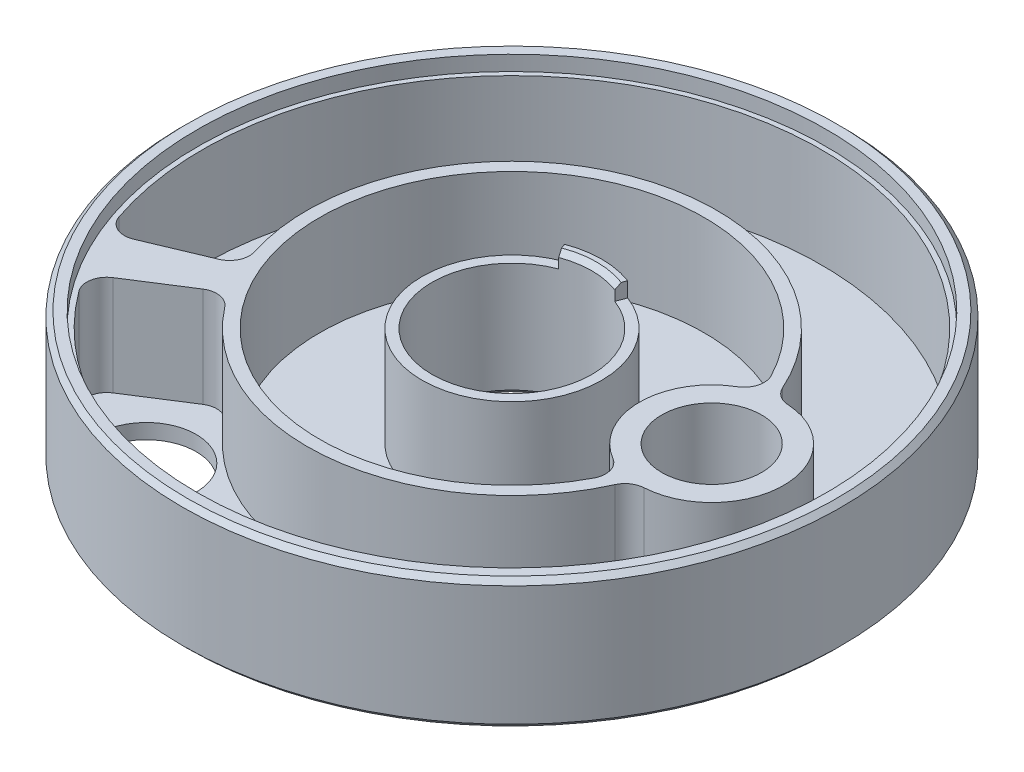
ISO-10303-21;
HEADER;
FILE_DESCRIPTION(('STEP AP214'),'2;1');
FILE_NAME('part.step','',(''),(''),'','','');
FILE_SCHEMA(('AUTOMOTIVE_DESIGN { 1 0 10303 214 1 1 1 1 }'));
ENDSEC;
DATA;
#1=APPLICATION_CONTEXT('core data for automotive mechanical design processes');
#2=APPLICATION_PROTOCOL_DEFINITION('international standard','automotive_design',2000,#1);
#3=PRODUCT_CONTEXT('',#1,'mechanical');
#4=PRODUCT('Part','Part','',(#3));
#5=PRODUCT_RELATED_PRODUCT_CATEGORY('part','',(#4));
#6=PRODUCT_DEFINITION_FORMATION('','',#4);
#7=PRODUCT_DEFINITION_CONTEXT('part definition',#1,'design');
#8=PRODUCT_DEFINITION('design','',#6,#7);
#9=PRODUCT_DEFINITION_SHAPE('','',#8);
#10=(LENGTH_UNIT() NAMED_UNIT(*) SI_UNIT(.MILLI.,.METRE.));
#11=(NAMED_UNIT(*) PLANE_ANGLE_UNIT() SI_UNIT($,.RADIAN.));
#12=(NAMED_UNIT(*) SI_UNIT($,.STERADIAN.) SOLID_ANGLE_UNIT());
#13=UNCERTAINTY_MEASURE_WITH_UNIT(LENGTH_MEASURE(1.E-05),#10,'distance_accuracy_value','');
#14=(GEOMETRIC_REPRESENTATION_CONTEXT(3) GLOBAL_UNCERTAINTY_ASSIGNED_CONTEXT((#13)) GLOBAL_UNIT_ASSIGNED_CONTEXT((#10,
#11,#12)) REPRESENTATION_CONTEXT('',''));
#15=CARTESIAN_POINT('',(0.,0.,0.));
#16=DIRECTION('',(0.,0.,1.));
#17=DIRECTION('',(1.,0.,0.));
#18=AXIS2_PLACEMENT_3D('',#15,#16,#17);
#19=CARTESIAN_POINT('',(0.,-1.5,0.));
#20=DIRECTION('',(0.,1.,0.));
#21=DIRECTION('',(0.,0.,1.));
#22=AXIS2_PLACEMENT_3D('',#19,#20,#21);
#23=PLANE('',#22);
#24=DIRECTION('',(0.351123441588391,0.,0.936329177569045));
#25=VECTOR('',#24,1.);
#26=CARTESIAN_POINT('',(-3.,-1.5,-8.));
#27=LINE('',#26,#25);
#28=CARTESIAN_POINT('',(-3.16011097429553,-1.5,-8.4269625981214));
#29=VERTEX_POINT('',#28);
#30=CARTESIAN_POINT('',(-2.80898753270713,-1.5,-7.49063342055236));
#31=VERTEX_POINT('',#30);
#32=EDGE_CURVE('E326',#29,#31,#27,.T.);
#33=ORIENTED_EDGE('',*,*,#32,.F.);
#34=CARTESIAN_POINT('',(0.,-1.5,0.));
#35=DIRECTION('',(0.,1.,0.));
#36=DIRECTION('',(0.,0.,1.));
#37=AXIS2_PLACEMENT_3D('',#34,#35,#36);
#38=CIRCLE('',#37,9.);
#39=CARTESIAN_POINT('',(3.16011097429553,-1.5,-8.4269625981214));
#40=VERTEX_POINT('',#39);
#41=EDGE_CURVE('E203',#29,#40,#38,.T.);
#42=ORIENTED_EDGE('',*,*,#41,.T.);
#43=DIRECTION('',(0.351123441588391,0.,-0.936329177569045));
#44=VECTOR('',#43,1.);
#45=CARTESIAN_POINT('',(3.,-1.5,-8.));
#46=LINE('',#45,#44);
#47=CARTESIAN_POINT('',(2.80898753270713,-1.5,-7.49063342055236));
#48=VERTEX_POINT('',#47);
#49=EDGE_CURVE('E323',#48,#40,#46,.T.);
#50=ORIENTED_EDGE('',*,*,#49,.F.);
#51=CARTESIAN_POINT('',(0.,-1.5,0.));
#52=DIRECTION('',(0.,1.,0.));
#53=DIRECTION('',(0.,0.,1.));
#54=AXIS2_PLACEMENT_3D('',#51,#52,#53);
#55=CIRCLE('',#54,8.);
#56=EDGE_CURVE('E329',#31,#48,#55,.T.);
#57=ORIENTED_EDGE('',*,*,#56,.F.);
#58=EDGE_LOOP('',(#33,#42,#50,#57));
#59=FACE_BOUND('',#58,.T.);
#60=ADVANCED_FACE('F32',(#59),#23,.T.);
#61=CARTESIAN_POINT('',(0.,0.,0.));
#62=DIRECTION('',(0.,1.,0.));
#63=DIRECTION('',(0.,0.,1.));
#64=AXIS2_PLACEMENT_3D('',#61,#62,#63);
#65=PLANE('',#64);
#66=DIRECTION('',(0.351123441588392,0.,0.936329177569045));
#67=VECTOR('',#66,1.);
#68=CARTESIAN_POINT('',(-2.80898753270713,0.,-7.49063342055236));
#69=LINE('',#68,#67);
#70=CARTESIAN_POINT('',(-3.16011097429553,0.,-8.4269625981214));
#71=VERTEX_POINT('',#70);
#72=CARTESIAN_POINT('',(-2.98454925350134,0.,-7.95879800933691));
#73=VERTEX_POINT('',#72);
#74=EDGE_CURVE('E335',#71,#73,#69,.T.);
#75=ORIENTED_EDGE('',*,*,#74,.T.);
#76=CARTESIAN_POINT('',(0.,0.,0.));
#77=DIRECTION('',(0.,1.,0.));
#78=DIRECTION('',(0.,0.,1.));
#79=AXIS2_PLACEMENT_3D('',#76,#77,#78);
#80=CIRCLE('',#79,8.50000000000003);
#81=CARTESIAN_POINT('',(2.98454925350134,0.,-7.95879800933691));
#82=VERTEX_POINT('',#81);
#83=EDGE_CURVE('E363',#73,#82,#80,.F.);
#84=ORIENTED_EDGE('',*,*,#83,.T.);
#85=DIRECTION('',(0.351123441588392,0.,-0.936329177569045));
#86=VECTOR('',#85,1.);
#87=CARTESIAN_POINT('',(2.80898753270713,0.,-7.49063342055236));
#88=LINE('',#87,#86);
#89=CARTESIAN_POINT('',(3.16011097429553,0.,-8.4269625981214));
#90=VERTEX_POINT('',#89);
#91=EDGE_CURVE('E327',#82,#90,#88,.T.);
#92=ORIENTED_EDGE('',*,*,#91,.T.);
#93=CARTESIAN_POINT('',(0.,0.,0.));
#94=DIRECTION('',(0.,1.,0.));
#95=DIRECTION('',(0.,0.,1.));
#96=AXIS2_PLACEMENT_3D('',#93,#94,#95);
#97=CIRCLE('',#96,9.);
#98=EDGE_CURVE('E320',#90,#71,#97,.T.);
#99=ORIENTED_EDGE('',*,*,#98,.T.);
#100=EDGE_LOOP('',(#75,#84,#92,#99));
#101=FACE_BOUND('',#100,.T.);
#102=ADVANCED_FACE('F396',(#101),#65,.T.);
#103=CARTESIAN_POINT('',(0.,-13.,0.));
#104=DIRECTION('',(0.,1.,0.));
#105=DIRECTION('',(0.,0.,1.));
#106=AXIS2_PLACEMENT_3D('',#103,#104,#105);
#107=CYLINDRICAL_SURFACE('',#106,8.);
#108=CARTESIAN_POINT('',(0.,-12.5,0.));
#109=DIRECTION('',(0.,1.,0.));
#110=DIRECTION('',(0.,0.,1.));
#111=AXIS2_PLACEMENT_3D('',#108,#109,#110);
#112=CIRCLE('',#111,8.);
#113=CARTESIAN_POINT('',(0.,-12.5,8.));
#114=VERTEX_POINT('',#113);
#115=EDGE_CURVE('E353',#114,#114,#112,.F.);
#116=ORIENTED_EDGE('',*,*,#115,.T.);
#117=EDGE_LOOP('',(#116));
#118=FACE_BOUND('',#117,.T.);
#119=DIRECTION('',(0.,1.,0.));
#120=VECTOR('',#119,1.);
#121=CARTESIAN_POINT('',(2.80898753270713,-1.5,-7.49063342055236));
#122=LINE('',#121,#120);
#123=CARTESIAN_POINT('',(2.80898753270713,-0.500000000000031,-7.49063342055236));
#124=VERTEX_POINT('',#123);
#125=EDGE_CURVE('E339',#48,#124,#122,.T.);
#126=ORIENTED_EDGE('',*,*,#125,.T.);
#127=CARTESIAN_POINT('',(0.,-0.500000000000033,0.));
#128=DIRECTION('',(0.,1.,0.));
#129=DIRECTION('',(0.,0.,1.));
#130=AXIS2_PLACEMENT_3D('',#127,#128,#129);
#131=CIRCLE('',#130,8.);
#132=CARTESIAN_POINT('',(-2.80898753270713,-0.500000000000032,-7.49063342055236));
#133=VERTEX_POINT('',#132);
#134=EDGE_CURVE('E358',#124,#133,#131,.T.);
#135=ORIENTED_EDGE('',*,*,#134,.T.);
#136=DIRECTION('',(0.,1.,0.));
#137=VECTOR('',#136,1.);
#138=CARTESIAN_POINT('',(-2.80898753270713,-1.5,-7.49063342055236));
#139=LINE('',#138,#137);
#140=EDGE_CURVE('E343',#31,#133,#139,.T.);
#141=ORIENTED_EDGE('',*,*,#140,.F.);
#142=ORIENTED_EDGE('',*,*,#56,.T.);
#143=EDGE_LOOP('',(#126,#135,#141,#142));
#144=FACE_BOUND('',#143,.T.);
#145=ADVANCED_FACE('F403',(#118,#144),#107,.F.);
#146=CARTESIAN_POINT('',(0.,-13.,0.));
#147=DIRECTION('',(0.,1.,0.));
#148=DIRECTION('',(0.,0.,1.));
#149=AXIS2_PLACEMENT_3D('',#146,#147,#148);
#150=CYLINDRICAL_SURFACE('',#149,33.);
#151=CARTESIAN_POINT('',(0.,-12.5,0.));
#152=DIRECTION('',(0.,1.,0.));
#153=DIRECTION('',(0.,0.,1.));
#154=AXIS2_PLACEMENT_3D('',#151,#152,#153);
#155=CIRCLE('',#154,33.);
#156=CARTESIAN_POINT('',(0.,-12.5,33.));
#157=VERTEX_POINT('',#156);
#158=EDGE_CURVE('E40',#157,#157,#155,.T.);
#159=CARTESIAN_POINT('',(0.,-0.499999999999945,0.));
#160=DIRECTION('',(0.,1.,0.));
#161=DIRECTION('',(0.,0.,1.));
#162=AXIS2_PLACEMENT_3D('',#159,#160,#161);
#163=CIRCLE('',#162,33.);
#164=CARTESIAN_POINT('',(0.,-0.499999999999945,33.));
#165=VERTEX_POINT('',#164);
#166=EDGE_CURVE('E373',#165,#165,#163,.F.);
#167=CARTESIAN_POINT('',(0.,-12.5,33.));
#168=CARTESIAN_POINT('',(0.,-12.375,33.));
#169=CARTESIAN_POINT('',(0.,-12.25,33.));
#170=CARTESIAN_POINT('',(0.,-12.,33.));
#171=CARTESIAN_POINT('',(0.,-11.875,33.));
#172=CARTESIAN_POINT('',(0.,-11.625,33.));
#173=CARTESIAN_POINT('',(0.,-11.5,33.));
#174=CARTESIAN_POINT('',(0.,-11.25,33.));
#175=CARTESIAN_POINT('',(0.,-11.125,33.));
#176=CARTESIAN_POINT('',(0.,-10.875,33.));
#177=CARTESIAN_POINT('',(0.,-10.75,33.));
#178=CARTESIAN_POINT('',(0.,-10.5,33.));
#179=CARTESIAN_POINT('',(0.,-10.375,33.));
#180=CARTESIAN_POINT('',(0.,-10.125,33.));
#181=CARTESIAN_POINT('',(0.,-9.99999999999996,33.));
#182=CARTESIAN_POINT('',(0.,-9.74999999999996,33.));
#183=CARTESIAN_POINT('',(0.,-9.62499999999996,33.));
#184=CARTESIAN_POINT('',(0.,-9.37499999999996,33.));
#185=CARTESIAN_POINT('',(0.,-9.24999999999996,33.));
#186=CARTESIAN_POINT('',(0.,-8.99999999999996,33.));
#187=CARTESIAN_POINT('',(0.,-8.87499999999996,33.));
#188=CARTESIAN_POINT('',(0.,-8.62499999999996,33.));
#189=CARTESIAN_POINT('',(0.,-8.49999999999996,33.));
#190=CARTESIAN_POINT('',(0.,-8.24999999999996,33.));
#191=CARTESIAN_POINT('',(0.,-8.12499999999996,33.));
#192=CARTESIAN_POINT('',(0.,-7.87499999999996,33.));
#193=CARTESIAN_POINT('',(0.,-7.74999999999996,33.));
#194=CARTESIAN_POINT('',(0.,-7.49999999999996,33.));
#195=CARTESIAN_POINT('',(0.,-7.37499999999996,33.));
#196=CARTESIAN_POINT('',(0.,-7.12499999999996,33.));
#197=CARTESIAN_POINT('',(0.,-6.99999999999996,33.));
#198=CARTESIAN_POINT('',(0.,-6.74999999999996,33.));
#199=CARTESIAN_POINT('',(0.,-6.62499999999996,33.));
#200=CARTESIAN_POINT('',(0.,-6.37499999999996,33.));
#201=CARTESIAN_POINT('',(0.,-6.24999999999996,33.));
#202=CARTESIAN_POINT('',(0.,-5.99999999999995,33.));
#203=CARTESIAN_POINT('',(0.,-5.87499999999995,33.));
#204=CARTESIAN_POINT('',(0.,-5.62499999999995,33.));
#205=CARTESIAN_POINT('',(0.,-5.49999999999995,33.));
#206=CARTESIAN_POINT('',(0.,-5.24999999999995,33.));
#207=CARTESIAN_POINT('',(0.,-5.12499999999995,33.));
#208=CARTESIAN_POINT('',(0.,-4.87499999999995,33.));
#209=CARTESIAN_POINT('',(0.,-4.74999999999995,33.));
#210=CARTESIAN_POINT('',(0.,-4.49999999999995,33.));
#211=CARTESIAN_POINT('',(0.,-4.37499999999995,33.));
#212=CARTESIAN_POINT('',(0.,-4.12499999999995,33.));
#213=CARTESIAN_POINT('',(0.,-3.99999999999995,33.));
#214=CARTESIAN_POINT('',(0.,-3.74999999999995,33.));
#215=CARTESIAN_POINT('',(0.,-3.62499999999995,33.));
#216=CARTESIAN_POINT('',(0.,-3.37499999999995,33.));
#217=CARTESIAN_POINT('',(0.,-3.24999999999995,33.));
#218=CARTESIAN_POINT('',(0.,-2.99999999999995,33.));
#219=CARTESIAN_POINT('',(0.,-2.87499999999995,33.));
#220=CARTESIAN_POINT('',(0.,-2.62499999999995,33.));
#221=CARTESIAN_POINT('',(0.,-2.49999999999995,33.));
#222=CARTESIAN_POINT('',(0.,-2.24999999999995,33.));
#223=CARTESIAN_POINT('',(0.,-2.12499999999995,33.));
#224=CARTESIAN_POINT('',(0.,-1.87499999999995,33.));
#225=CARTESIAN_POINT('',(0.,-1.74999999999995,33.));
#226=CARTESIAN_POINT('',(0.,-1.49999999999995,33.));
#227=CARTESIAN_POINT('',(0.,-1.37499999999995,33.));
#228=CARTESIAN_POINT('',(0.,-1.12499999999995,33.));
#229=CARTESIAN_POINT('',(0.,-0.999999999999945,33.));
#230=CARTESIAN_POINT('',(0.,-0.749999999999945,33.));
#231=CARTESIAN_POINT('',(0.,-0.624999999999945,33.));
#232=CARTESIAN_POINT('',(0.,-0.499999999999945,33.));
#233=B_SPLINE_CURVE_WITH_KNOTS('',3,(#167,#168,#169,#170,#171,#172,#173,#174,#175,#176,#177,
#178,#179,#180,#181,#182,#183,#184,#185,#186,#187,#188,#189,#190,#191,#192,#193,#194,#195,#196,
#197,#198,#199,#200,#201,#202,#203,#204,#205,#206,#207,#208,#209,#210,#211,#212,#213,#214,#215,
#216,#217,#218,#219,#220,#221,#222,#223,#224,#225,#226,#227,#228,#229,#230,#231,#232),
.UNSPECIFIED.,.F.,.F.,(4,2,2,2,2,2,2,2,2,2,2,2,2,2,2,2,2,2,2,2,2,2,2,2,2,2,2,2,2,2,2,2,4),(0.,
0.375,0.750000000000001,1.125,1.5,1.875,2.25,2.625,3.,3.375,3.75,4.12500000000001,
4.50000000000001,4.87500000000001,5.25000000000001,5.62500000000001,6.00000000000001,
6.37500000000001,6.75000000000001,7.12500000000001,7.50000000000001,7.87500000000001,
8.25000000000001,8.62500000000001,9.00000000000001,9.37500000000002,9.75000000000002,10.125,
10.5,10.875,11.25,11.625,12.),.UNSPECIFIED.);
#234=EDGE_CURVE('BSEAM378',#157,#165,#233,.T.);
#235=ORIENTED_EDGE('',*,*,#158,.T.);
#236=ORIENTED_EDGE('',*,*,#166,.T.);
#237=ORIENTED_EDGE('',*,*,#234,.T.);
#238=ORIENTED_EDGE('',*,*,#234,.F.);
#239=EDGE_LOOP('',(#235,#237,#236,#238));
#240=FACE_BOUND('',#239,.T.);
#241=ADVANCED_FACE('F378',(#240),#150,.T.);
#242=CARTESIAN_POINT('',(0.,-13.,0.));
#243=DIRECTION('',(0.,1.,0.));
#244=DIRECTION('',(0.,0.,1.));
#245=AXIS2_PLACEMENT_3D('',#242,#243,#244);
#246=PLANE('',#245);
#247=CARTESIAN_POINT('',(-16.6132477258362,-13.,20.));
#248=DIRECTION('',(0.,1.,0.));
#249=DIRECTION('',(0.,0.,1.));
#250=AXIS2_PLACEMENT_3D('',#247,#248,#249);
#251=CIRCLE('',#250,5.);
#252=CARTESIAN_POINT('',(-16.6132477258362,-13.,25.));
#253=VERTEX_POINT('',#252);
#254=EDGE_CURVE('E549',#253,#253,#251,.T.);
#255=ORIENTED_EDGE('',*,*,#254,.T.);
#256=EDGE_LOOP('',(#255));
#257=FACE_BOUND('',#256,.T.);
#258=CARTESIAN_POINT('',(20.,-13.,0.));
#259=DIRECTION('',(0.,1.,0.));
#260=DIRECTION('',(0.,0.,1.));
#261=AXIS2_PLACEMENT_3D('',#258,#259,#260);
#262=CIRCLE('',#261,5.);
#263=CARTESIAN_POINT('',(20.,-13.,5.));
#264=VERTEX_POINT('',#263);
#265=EDGE_CURVE('E317',#264,#264,#262,.T.);
#266=ORIENTED_EDGE('',*,*,#265,.T.);
#267=EDGE_LOOP('',(#266));
#268=FACE_BOUND('',#267,.T.);
#269=CARTESIAN_POINT('',(0.,-13.,0.));
#270=DIRECTION('',(0.,1.,0.));
#271=DIRECTION('',(0.,0.,1.));
#272=AXIS2_PLACEMENT_3D('',#269,#270,#271);
#273=CIRCLE('',#272,8.49999999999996);
#274=CARTESIAN_POINT('',(0.,-13.,8.49999999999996));
#275=VERTEX_POINT('',#274);
#276=EDGE_CURVE('E370',#275,#275,#273,.T.);
#277=ORIENTED_EDGE('',*,*,#276,.T.);
#278=EDGE_LOOP('',(#277));
#279=FACE_BOUND('',#278,.T.);
#280=CARTESIAN_POINT('',(0.,-13.,0.));
#281=DIRECTION('',(0.,1.,0.));
#282=DIRECTION('',(0.,0.,1.));
#283=AXIS2_PLACEMENT_3D('',#280,#281,#282);
#284=CIRCLE('',#283,32.5);
#285=CARTESIAN_POINT('',(0.,-13.,32.5));
#286=VERTEX_POINT('',#285);
#287=EDGE_CURVE('E367',#286,#286,#284,.F.);
#288=ORIENTED_EDGE('',*,*,#287,.T.);
#289=EDGE_LOOP('',(#288));
#290=FACE_BOUND('',#289,.T.);
#291=ADVANCED_FACE('F435',(#257,#268,#279,#290),#246,.F.);
#292=CARTESIAN_POINT('',(0.,0.,0.));
#293=DIRECTION('',(0.,1.,0.));
#294=DIRECTION('',(0.,0.,1.));
#295=AXIS2_PLACEMENT_3D('',#292,#293,#294);
#296=CIRCLE('',#295,32.5);
#297=CARTESIAN_POINT('',(0.,0.,32.5));
#298=VERTEX_POINT('',#297);
#299=EDGE_CURVE('E11',#298,#298,#296,.T.);
#300=ORIENTED_EDGE('',*,*,#299,.T.);
#301=EDGE_LOOP('',(#300));
#302=FACE_BOUND('',#301,.T.);
#303=CARTESIAN_POINT('',(0.,0.,0.));
#304=DIRECTION('',(0.,1.,0.));
#305=DIRECTION('',(0.,0.,1.));
#306=AXIS2_PLACEMENT_3D('',#303,#304,#305);
#307=CIRCLE('',#306,31.5);
#308=CARTESIAN_POINT('',(0.,0.,31.5));
#309=VERTEX_POINT('',#308);
#310=EDGE_CURVE('E342',#309,#309,#307,.T.);
#311=ORIENTED_EDGE('',*,*,#310,.F.);
#312=EDGE_LOOP('',(#311));
#313=FACE_BOUND('',#312,.T.);
#314=ADVANCED_FACE('F406',(#302,#313),#65,.T.);
#315=CARTESIAN_POINT('',(0.,-1.5,0.));
#316=DIRECTION('',(0.,1.,0.));
#317=DIRECTION('',(0.,0.,1.));
#318=AXIS2_PLACEMENT_3D('',#315,#316,#317);
#319=CYLINDRICAL_SURFACE('',#318,31.5);
#320=CARTESIAN_POINT('',(0.,-1.5,0.));
#321=DIRECTION('',(0.,1.,0.));
#322=DIRECTION('',(0.,0.,1.));
#323=AXIS2_PLACEMENT_3D('',#320,#321,#322);
#324=CIRCLE('',#323,31.5);
#325=CARTESIAN_POINT('',(0.,-1.5,31.5));
#326=VERTEX_POINT('',#325);
#327=EDGE_CURVE('E350',#326,#326,#324,.T.);
#328=ORIENTED_EDGE('',*,*,#327,.F.);
#329=EDGE_LOOP('',(#328));
#330=FACE_BOUND('',#329,.T.);
#331=ORIENTED_EDGE('',*,*,#310,.T.);
#332=EDGE_LOOP('',(#331));
#333=FACE_BOUND('',#332,.T.);
#334=ADVANCED_FACE('F412',(#330,#333),#319,.F.);
#335=CARTESIAN_POINT('',(15.3140625,-1.5,7.93989859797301));
#336=DIRECTION('',(0.,1.,0.));
#337=DIRECTION('',(0.,0.,1.));
#338=AXIS2_PLACEMENT_3D('',#335,#336,#337);
#339=CIRCLE('',#338,2.);
#340=CARTESIAN_POINT('',(17.0896059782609,-1.5,8.86046655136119));
#341=VERTEX_POINT('',#340);
#342=CARTESIAN_POINT('',(16.3305850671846,-1.5,6.21749276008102));
#343=VERTEX_POINT('',#342);
#344=EDGE_CURVE('E52',#341,#343,#339,.T.);
#345=ORIENTED_EDGE('',*,*,#344,.F.);
#346=CARTESIAN_POINT('',(0.,-1.5,0.));
#347=DIRECTION('',(0.,1.,0.));
#348=DIRECTION('',(0.,0.,1.));
#349=AXIS2_PLACEMENT_3D('',#346,#347,#348);
#350=CIRCLE('',#349,19.25);
#351=CARTESIAN_POINT('',(17.0896059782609,-1.5,-8.86046655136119));
#352=VERTEX_POINT('',#351);
#353=EDGE_CURVE('E197',#352,#341,#350,.T.);
#354=ORIENTED_EDGE('',*,*,#353,.F.);
#355=CARTESIAN_POINT('',(15.3140625,-1.5,-7.93989859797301));
#356=DIRECTION('',(0.,1.,0.));
#357=DIRECTION('',(0.,0.,-1.));
#358=AXIS2_PLACEMENT_3D('',#355,#356,#357);
#359=CIRCLE('',#358,2.);
#360=CARTESIAN_POINT('',(16.3305850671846,-1.5,-6.21749276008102));
#361=VERTEX_POINT('',#360);
#362=EDGE_CURVE('E200',#361,#352,#359,.T.);
#363=ORIENTED_EDGE('',*,*,#362,.F.);
#364=CARTESIAN_POINT('',(20.,-1.5,0.));
#365=DIRECTION('',(0.,-1.,0.));
#366=DIRECTION('',(0.,0.,1.));
#367=AXIS2_PLACEMENT_3D('',#364,#365,#366);
#368=CIRCLE('',#367,7.21954445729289);
#369=EDGE_CURVE('E209',#343,#361,#368,.T.);
#370=ORIENTED_EDGE('',*,*,#369,.F.);
#371=EDGE_LOOP('',(#345,#354,#363,#370));
#372=FACE_BOUND('',#371,.T.);
#373=CARTESIAN_POINT('',(20.53125,-1.5,-9.20422584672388));
#374=DIRECTION('',(0.,1.,0.));
#375=DIRECTION('',(0.,0.,1.));
#376=AXIS2_PLACEMENT_3D('',#373,#374,#375);
#377=CIRCLE('',#376,2.);
#378=CARTESIAN_POINT('',(18.70625,-1.5,-8.38607243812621));
#379=VERTEX_POINT('',#378);
#380=CARTESIAN_POINT('',(20.4160056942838,-1.5,-7.20754891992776));
#381=VERTEX_POINT('',#380);
#382=EDGE_CURVE('E216',#379,#381,#377,.T.);
#383=ORIENTED_EDGE('',*,*,#382,.F.);
#384=CARTESIAN_POINT('',(0.,-1.5,0.));
#385=DIRECTION('',(0.,-1.,0.));
#386=DIRECTION('',(0.,0.,1.));
#387=AXIS2_PLACEMENT_3D('',#384,#385,#386);
#388=CIRCLE('',#387,20.5);
#389=CARTESIAN_POINT('',(-19.5309015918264,-1.5,6.22847356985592));
#390=VERTEX_POINT('',#389);
#391=EDGE_CURVE('E224',#390,#379,#388,.T.);
#392=ORIENTED_EDGE('',*,*,#391,.F.);
#393=CARTESIAN_POINT('',(-21.4363554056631,-1.5,6.83612952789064));
#394=DIRECTION('',(0.,1.,0.));
#395=DIRECTION('',(0.,0.,1.));
#396=AXIS2_PLACEMENT_3D('',#393,#394,#395);
#397=CIRCLE('',#396,2.);
#398=CARTESIAN_POINT('',(-20.6617311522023,-1.5,8.6800268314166));
#399=VERTEX_POINT('',#398);
#400=EDGE_CURVE('E287',#399,#390,#397,.T.);
#401=ORIENTED_EDGE('',*,*,#400,.F.);
#402=DIRECTION('',(0.921948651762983,0.,-0.387312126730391));
#403=VECTOR('',#402,1.);
#404=CARTESIAN_POINT('',(-20.6617311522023,-1.5,8.6800268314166));
#405=LINE('',#404,#403);
#406=CARTESIAN_POINT('',(-26.6728524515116,-1.5,11.205308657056));
#407=VERTEX_POINT('',#406);
#408=EDGE_CURVE('E284',#407,#399,#405,.T.);
#409=ORIENTED_EDGE('',*,*,#408,.F.);
#410=CARTESIAN_POINT('',(-27.4474767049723,-1.5,9.36141135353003));
#411=DIRECTION('',(0.,1.,0.));
#412=DIRECTION('',(0.,0.,-1.));
#413=AXIS2_PLACEMENT_3D('',#410,#411,#412);
#414=CIRCLE('',#413,2.);
#415=CARTESIAN_POINT('',(-29.3404061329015,-1.5,10.0070259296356));
#416=VERTEX_POINT('',#415);
#417=EDGE_CURVE('E281',#416,#407,#414,.T.);
#418=ORIENTED_EDGE('',*,*,#417,.F.);
#419=CARTESIAN_POINT('',(0.,-1.5,0.));
#420=DIRECTION('',(0.,1.,0.));
#421=DIRECTION('',(0.,0.,1.));
#422=AXIS2_PLACEMENT_3D('',#419,#420,#421);
#423=CIRCLE('',#422,31.);
#424=CARTESIAN_POINT('',(-24.9120718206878,-1.5,18.4496254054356));
#425=VERTEX_POINT('',#424);
#426=EDGE_CURVE('E278',#425,#416,#423,.T.);
#427=ORIENTED_EDGE('',*,*,#426,.F.);
#428=CARTESIAN_POINT('',(-23.3048413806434,-1.5,17.2593269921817));
#429=DIRECTION('',(0.,1.,0.));
#430=DIRECTION('',(0.,0.,1.));
#431=AXIS2_PLACEMENT_3D('',#428,#429,#430);
#432=CIRCLE('',#431,2.);
#433=CARTESIAN_POINT('',(-24.3814622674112,-1.5,15.5738337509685));
#434=VERTEX_POINT('',#433);
#435=EDGE_CURVE('E275',#434,#425,#432,.T.);
#436=ORIENTED_EDGE('',*,*,#435,.F.);
#437=DIRECTION('',(-0.842746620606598,0.,0.538310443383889));
#438=VECTOR('',#437,1.);
#439=CARTESIAN_POINT('',(-18.8867395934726,-1.5,12.0640402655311));
#440=LINE('',#439,#438);
#441=CARTESIAN_POINT('',(-18.8867395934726,-1.5,12.0640402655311));
#442=VERTEX_POINT('',#441);
#443=EDGE_CURVE('E272',#442,#434,#440,.T.);
#444=ORIENTED_EDGE('',*,*,#443,.F.);
#445=CARTESIAN_POINT('',(-17.8101187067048,-1.5,13.7495335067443));
#446=DIRECTION('',(0.,1.,0.));
#447=DIRECTION('',(0.,0.,-1.));
#448=AXIS2_PLACEMENT_3D('',#445,#446,#447);
#449=CIRCLE('',#448,2.);
#450=CARTESIAN_POINT('',(-16.2269970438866,-1.5,12.5273527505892));
#451=VERTEX_POINT('',#450);
#452=EDGE_CURVE('E269',#451,#442,#449,.T.);
#453=ORIENTED_EDGE('',*,*,#452,.F.);
#454=CARTESIAN_POINT('',(0.,-1.5,0.));
#455=DIRECTION('',(0.,-1.,0.));
#456=DIRECTION('',(0.,0.,1.));
#457=AXIS2_PLACEMENT_3D('',#454,#455,#456);
#458=CIRCLE('',#457,20.5);
#459=CARTESIAN_POINT('',(18.70625,-1.5,8.38607243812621));
#460=VERTEX_POINT('',#459);
#461=EDGE_CURVE('E266',#460,#451,#458,.T.);
#462=ORIENTED_EDGE('',*,*,#461,.F.);
#463=CARTESIAN_POINT('',(20.53125,-1.5,9.20422584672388));
#464=DIRECTION('',(0.,1.,0.));
#465=DIRECTION('',(0.,0.,-1.));
#466=AXIS2_PLACEMENT_3D('',#463,#464,#465);
#467=CIRCLE('',#466,2.);
#468=CARTESIAN_POINT('',(20.4160056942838,-1.5,7.20754891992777));
#469=VERTEX_POINT('',#468);
#470=EDGE_CURVE('E263',#469,#460,#467,.T.);
#471=ORIENTED_EDGE('',*,*,#470,.F.);
#472=CARTESIAN_POINT('',(20.,-1.5,0.));
#473=DIRECTION('',(0.,-1.,0.));
#474=DIRECTION('',(0.,0.,1.));
#475=AXIS2_PLACEMENT_3D('',#472,#473,#474);
#476=CIRCLE('',#475,7.21954445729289);
#477=EDGE_CURVE('E260',#381,#469,#476,.T.);
#478=ORIENTED_EDGE('',*,*,#477,.F.);
#479=EDGE_LOOP('',(#383,#392,#401,#409,#418,#427,#436,#444,#453,#462,#471,#478));
#480=FACE_BOUND('',#479,.T.);
#481=CARTESIAN_POINT('',(20.,-1.5,0.));
#482=DIRECTION('',(0.,1.,0.));
#483=DIRECTION('',(0.,0.,1.));
#484=AXIS2_PLACEMENT_3D('',#481,#482,#483);
#485=CIRCLE('',#484,5.);
#486=CARTESIAN_POINT('',(20.,-1.5,5.));
#487=VERTEX_POINT('',#486);
#488=EDGE_CURVE('E294',#487,#487,#485,.T.);
#489=ORIENTED_EDGE('',*,*,#488,.F.);
#490=EDGE_LOOP('',(#489));
#491=FACE_BOUND('',#490,.T.);
#492=ORIENTED_EDGE('',*,*,#327,.T.);
#493=EDGE_LOOP('',(#492));
#494=FACE_BOUND('',#493,.T.);
#495=ADVANCED_FACE('F399',(#372,#480,#491,#494),#23,.T.);
#496=CARTESIAN_POINT('',(2.80898753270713,-1.5,-7.49063342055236));
#497=DIRECTION('',(0.936329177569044,0.,0.351123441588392));
#498=DIRECTION('',(0.351123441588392,0.,-0.936329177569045));
#499=AXIS2_PLACEMENT_3D('',#496,#497,#498);
#500=PLANE('',#499);
#501=ORIENTED_EDGE('',*,*,#91,.F.);
#502=DIRECTION('',(0.24828176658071,0.707106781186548,-0.662084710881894));
#503=VECTOR('',#502,1.);
#504=CARTESIAN_POINT('',(0.,-8.50000000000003,0.));
#505=LINE('',#504,#503);
#506=EDGE_CURVE('E365',#82,#124,#505,.F.);
#507=ORIENTED_EDGE('',*,*,#506,.T.);
#508=ORIENTED_EDGE('',*,*,#125,.F.);
#509=ORIENTED_EDGE('',*,*,#49,.T.);
#510=DIRECTION('',(0.,1.,0.));
#511=VECTOR('',#510,1.);
#512=CARTESIAN_POINT('',(3.16011097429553,-1.5,-8.4269625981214));
#513=LINE('',#512,#511);
#514=EDGE_CURVE('E332',#40,#90,#513,.T.);
#515=ORIENTED_EDGE('',*,*,#514,.T.);
#516=EDGE_LOOP('',(#501,#507,#508,#509,#515));
#517=FACE_BOUND('',#516,.T.);
#518=ADVANCED_FACE('F411',(#517),#500,.T.);
#519=CARTESIAN_POINT('',(-2.80898753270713,-1.5,-7.49063342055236));
#520=DIRECTION('',(-0.936329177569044,0.,0.351123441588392));
#521=DIRECTION('',(0.351123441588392,0.,0.936329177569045));
#522=AXIS2_PLACEMENT_3D('',#519,#520,#521);
#523=PLANE('',#522);
#524=ORIENTED_EDGE('',*,*,#140,.T.);
#525=DIRECTION('',(0.24828176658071,-0.707106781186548,0.662084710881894));
#526=VECTOR('',#525,1.);
#527=CARTESIAN_POINT('',(0.,-8.50000000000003,0.));
#528=LINE('',#527,#526);
#529=EDGE_CURVE('E361',#133,#73,#528,.F.);
#530=ORIENTED_EDGE('',*,*,#529,.T.);
#531=ORIENTED_EDGE('',*,*,#74,.F.);
#532=DIRECTION('',(0.,1.,0.));
#533=VECTOR('',#532,1.);
#534=CARTESIAN_POINT('',(-3.16011097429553,-1.5,-8.4269625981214));
#535=LINE('',#534,#533);
#536=EDGE_CURVE('E346',#29,#71,#535,.T.);
#537=ORIENTED_EDGE('',*,*,#536,.F.);
#538=ORIENTED_EDGE('',*,*,#32,.T.);
#539=EDGE_LOOP('',(#524,#530,#531,#537,#538));
#540=FACE_BOUND('',#539,.T.);
#541=ADVANCED_FACE('F418',(#540),#523,.T.);
#542=CARTESIAN_POINT('',(0.,-1.5,0.));
#543=DIRECTION('',(0.,1.,0.));
#544=DIRECTION('',(0.,0.,1.));
#545=AXIS2_PLACEMENT_3D('',#542,#543,#544);
#546=CYLINDRICAL_SURFACE('',#545,9.);
#547=ORIENTED_EDGE('',*,*,#98,.F.);
#548=ORIENTED_EDGE('',*,*,#514,.F.);
#549=ORIENTED_EDGE('',*,*,#41,.F.);
#550=ORIENTED_EDGE('',*,*,#536,.T.);
#551=EDGE_LOOP('',(#547,#548,#549,#550));
#552=FACE_BOUND('',#551,.T.);
#553=CARTESIAN_POINT('',(0.,-11.5,0.));
#554=DIRECTION('',(0.,1.,0.));
#555=DIRECTION('',(0.,0.,1.));
#556=AXIS2_PLACEMENT_3D('',#553,#554,#555);
#557=CIRCLE('',#556,9.);
#558=CARTESIAN_POINT('',(0.,-11.5,9.));
#559=VERTEX_POINT('',#558);
#560=EDGE_CURVE('E210',#559,#559,#557,.T.);
#561=ORIENTED_EDGE('',*,*,#560,.T.);
#562=EDGE_LOOP('',(#561));
#563=FACE_BOUND('',#562,.T.);
#564=ADVANCED_FACE('F447',(#552,#563),#546,.T.);
#565=CARTESIAN_POINT('',(0.,-0.500000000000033,0.));
#566=DIRECTION('',(0.,1.,0.));
#567=DIRECTION('',(0.,0.,1.));
#568=AXIS2_PLACEMENT_3D('',#565,#566,#567);
#569=CONICAL_SURFACE('',#568,8.,0.785398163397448);
#570=ORIENTED_EDGE('',*,*,#506,.F.);
#571=ORIENTED_EDGE('',*,*,#83,.F.);
#572=ORIENTED_EDGE('',*,*,#529,.F.);
#573=ORIENTED_EDGE('',*,*,#134,.F.);
#574=EDGE_LOOP('',(#570,#571,#572,#573));
#575=FACE_BOUND('',#574,.T.);
#576=ADVANCED_FACE('F391',(#575),#569,.F.);
#577=CARTESIAN_POINT('',(0.,-13.,0.));
#578=DIRECTION('',(0.,-1.,0.));
#579=DIRECTION('',(0.,0.,-1.));
#580=AXIS2_PLACEMENT_3D('',#577,#578,#579);
#581=CONICAL_SURFACE('',#580,8.49999999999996,0.785398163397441);
#582=ORIENTED_EDGE('',*,*,#115,.F.);
#583=EDGE_LOOP('',(#582));
#584=FACE_BOUND('',#583,.T.);
#585=ORIENTED_EDGE('',*,*,#276,.F.);
#586=EDGE_LOOP('',(#585));
#587=FACE_BOUND('',#586,.T.);
#588=ADVANCED_FACE('F383',(#584,#587),#581,.F.);
#589=CARTESIAN_POINT('',(0.,-12.5,0.));
#590=DIRECTION('',(0.,1.,0.));
#591=DIRECTION('',(0.,0.,1.));
#592=AXIS2_PLACEMENT_3D('',#589,#590,#591);
#593=CONICAL_SURFACE('',#592,33.,0.785398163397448);
#594=ORIENTED_EDGE('',*,*,#287,.F.);
#595=EDGE_LOOP('',(#594));
#596=FACE_BOUND('',#595,.T.);
#597=ORIENTED_EDGE('',*,*,#158,.F.);
#598=EDGE_LOOP('',(#597));
#599=FACE_BOUND('',#598,.T.);
#600=ADVANCED_FACE('F381',(#596,#599),#593,.T.);
#601=CARTESIAN_POINT('',(0.,0.,0.));
#602=DIRECTION('',(0.,-1.,0.));
#603=DIRECTION('',(0.,0.,-1.));
#604=AXIS2_PLACEMENT_3D('',#601,#602,#603);
#605=CONICAL_SURFACE('',#604,32.5,0.785398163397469);
#606=ORIENTED_EDGE('',*,*,#166,.F.);
#607=EDGE_LOOP('',(#606));
#608=FACE_BOUND('',#607,.T.);
#609=ORIENTED_EDGE('',*,*,#299,.F.);
#610=EDGE_LOOP('',(#609));
#611=FACE_BOUND('',#610,.T.);
#612=ADVANCED_FACE('F34',(#608,#611),#605,.T.);
#613=CARTESIAN_POINT('',(20.,-13.,0.));
#614=DIRECTION('',(0.,1.,0.));
#615=DIRECTION('',(0.,0.,1.));
#616=AXIS2_PLACEMENT_3D('',#613,#614,#615);
#617=CYLINDRICAL_SURFACE('',#616,5.);
#618=ORIENTED_EDGE('',*,*,#265,.F.);
#619=EDGE_LOOP('',(#618));
#620=FACE_BOUND('',#619,.T.);
#621=ORIENTED_EDGE('',*,*,#488,.T.);
#622=EDGE_LOOP('',(#621));
#623=FACE_BOUND('',#622,.T.);
#624=ADVANCED_FACE('F389',(#620,#623),#617,.F.);
#625=CARTESIAN_POINT('',(20.53125,-11.5,-9.20422584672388));
#626=DIRECTION('',(0.,1.,0.));
#627=DIRECTION('',(0.,0.,1.));
#628=AXIS2_PLACEMENT_3D('',#625,#626,#627);
#629=CYLINDRICAL_SURFACE('',#628,2.);
#630=ORIENTED_EDGE('',*,*,#382,.T.);
#631=DIRECTION('',(0.,1.,0.));
#632=VECTOR('',#631,1.);
#633=CARTESIAN_POINT('',(20.4160056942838,-11.5,-7.20754891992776));
#634=LINE('',#633,#632);
#635=CARTESIAN_POINT('',(20.4160056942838,-11.5,-7.20754891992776));
#636=VERTEX_POINT('',#635);
#637=EDGE_CURVE('E258',#636,#381,#634,.T.);
#638=ORIENTED_EDGE('',*,*,#637,.F.);
#639=CARTESIAN_POINT('',(20.53125,-11.5,-9.20422584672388));
#640=DIRECTION('',(0.,1.,0.));
#641=DIRECTION('',(0.,0.,1.));
#642=AXIS2_PLACEMENT_3D('',#639,#640,#641);
#643=CIRCLE('',#642,2.);
#644=CARTESIAN_POINT('',(18.70625,-11.5,-8.38607243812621));
#645=VERTEX_POINT('',#644);
#646=EDGE_CURVE('E220',#645,#636,#643,.T.);
#647=ORIENTED_EDGE('',*,*,#646,.F.);
#648=DIRECTION('',(0.,1.,0.));
#649=VECTOR('',#648,1.);
#650=CARTESIAN_POINT('',(18.70625,-11.5,-8.38607243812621));
#651=LINE('',#650,#649);
#652=EDGE_CURVE('E292',#645,#379,#651,.T.);
#653=ORIENTED_EDGE('',*,*,#652,.T.);
#654=EDGE_LOOP('',(#630,#638,#647,#653));
#655=FACE_BOUND('',#654,.T.);
#656=ADVANCED_FACE('F474',(#655),#629,.F.);
#657=CARTESIAN_POINT('',(0.,-11.5,0.));
#658=DIRECTION('',(0.,1.,0.));
#659=DIRECTION('',(0.,0.,1.));
#660=AXIS2_PLACEMENT_3D('',#657,#658,#659);
#661=CYLINDRICAL_SURFACE('',#660,20.5);
#662=ORIENTED_EDGE('',*,*,#391,.T.);
#663=ORIENTED_EDGE('',*,*,#652,.F.);
#664=CARTESIAN_POINT('',(0.,-11.5,0.));
#665=DIRECTION('',(0.,-1.,0.));
#666=DIRECTION('',(0.,0.,1.));
#667=AXIS2_PLACEMENT_3D('',#664,#665,#666);
#668=CIRCLE('',#667,20.5);
#669=CARTESIAN_POINT('',(-19.5309015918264,-11.5,6.22847356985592));
#670=VERTEX_POINT('',#669);
#671=EDGE_CURVE('E255',#670,#645,#668,.T.);
#672=ORIENTED_EDGE('',*,*,#671,.F.);
#673=DIRECTION('',(0.,1.,0.));
#674=VECTOR('',#673,1.);
#675=CARTESIAN_POINT('',(-19.5309015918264,-11.5,6.22847356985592));
#676=LINE('',#675,#674);
#677=EDGE_CURVE('E295',#670,#390,#676,.T.);
#678=ORIENTED_EDGE('',*,*,#677,.T.);
#679=EDGE_LOOP('',(#662,#663,#672,#678));
#680=FACE_BOUND('',#679,.T.);
#681=ADVANCED_FACE('F478',(#680),#661,.T.);
#682=CARTESIAN_POINT('',(-21.4363554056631,-11.5,6.83612952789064));
#683=DIRECTION('',(0.,1.,0.));
#684=DIRECTION('',(0.,0.,1.));
#685=AXIS2_PLACEMENT_3D('',#682,#683,#684);
#686=CYLINDRICAL_SURFACE('',#685,2.);
#687=ORIENTED_EDGE('',*,*,#400,.T.);
#688=ORIENTED_EDGE('',*,*,#677,.F.);
#689=CARTESIAN_POINT('',(-21.4363554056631,-11.5,6.83612952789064));
#690=DIRECTION('',(0.,1.,0.));
#691=DIRECTION('',(0.,0.,1.));
#692=AXIS2_PLACEMENT_3D('',#689,#690,#691);
#693=CIRCLE('',#692,2.);
#694=CARTESIAN_POINT('',(-20.6617311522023,-11.5,8.6800268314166));
#695=VERTEX_POINT('',#694);
#696=EDGE_CURVE('E252',#695,#670,#693,.T.);
#697=ORIENTED_EDGE('',*,*,#696,.F.);
#698=DIRECTION('',(0.,1.,0.));
#699=VECTOR('',#698,1.);
#700=CARTESIAN_POINT('',(-20.6617311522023,-11.5,8.6800268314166));
#701=LINE('',#700,#699);
#702=EDGE_CURVE('E297',#695,#399,#701,.T.);
#703=ORIENTED_EDGE('',*,*,#702,.T.);
#704=EDGE_LOOP('',(#687,#688,#697,#703));
#705=FACE_BOUND('',#704,.T.);
#706=ADVANCED_FACE('F516',(#705),#686,.F.);
#707=CARTESIAN_POINT('',(-20.6617311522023,-11.5,8.6800268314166));
#708=DIRECTION('',(0.387312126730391,0.,0.921948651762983));
#709=DIRECTION('',(0.921948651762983,0.,-0.387312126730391));
#710=AXIS2_PLACEMENT_3D('',#707,#708,#709);
#711=PLANE('',#710);
#712=ORIENTED_EDGE('',*,*,#408,.T.);
#713=ORIENTED_EDGE('',*,*,#702,.F.);
#714=DIRECTION('',(0.921948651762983,0.,-0.387312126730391));
#715=VECTOR('',#714,1.);
#716=CARTESIAN_POINT('',(-20.6617311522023,-11.5,8.6800268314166));
#717=LINE('',#716,#715);
#718=CARTESIAN_POINT('',(-26.6728524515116,-11.5,11.205308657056));
#719=VERTEX_POINT('',#718);
#720=EDGE_CURVE('E249',#719,#695,#717,.T.);
#721=ORIENTED_EDGE('',*,*,#720,.F.);
#722=DIRECTION('',(0.,1.,0.));
#723=VECTOR('',#722,1.);
#724=CARTESIAN_POINT('',(-26.6728524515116,-11.5,11.205308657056));
#725=LINE('',#724,#723);
#726=EDGE_CURVE('E299',#719,#407,#725,.T.);
#727=ORIENTED_EDGE('',*,*,#726,.T.);
#728=EDGE_LOOP('',(#712,#713,#721,#727));
#729=FACE_BOUND('',#728,.T.);
#730=ADVANCED_FACE('F512',(#729),#711,.F.);
#731=CARTESIAN_POINT('',(-27.4474767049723,-11.5,9.36141135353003));
#732=DIRECTION('',(0.,1.,0.));
#733=DIRECTION('',(0.,0.,1.));
#734=AXIS2_PLACEMENT_3D('',#731,#732,#733);
#735=CYLINDRICAL_SURFACE('',#734,2.);
#736=ORIENTED_EDGE('',*,*,#417,.T.);
#737=ORIENTED_EDGE('',*,*,#726,.F.);
#738=CARTESIAN_POINT('',(-27.4474767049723,-11.5,9.36141135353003));
#739=DIRECTION('',(0.,1.,0.));
#740=DIRECTION('',(0.,0.,-1.));
#741=AXIS2_PLACEMENT_3D('',#738,#739,#740);
#742=CIRCLE('',#741,2.);
#743=CARTESIAN_POINT('',(-29.3404061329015,-11.5,10.0070259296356));
#744=VERTEX_POINT('',#743);
#745=EDGE_CURVE('E246',#744,#719,#742,.T.);
#746=ORIENTED_EDGE('',*,*,#745,.F.);
#747=DIRECTION('',(0.,1.,0.));
#748=VECTOR('',#747,1.);
#749=CARTESIAN_POINT('',(-29.3404061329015,-11.5,10.0070259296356));
#750=LINE('',#749,#748);
#751=EDGE_CURVE('E301',#744,#416,#750,.T.);
#752=ORIENTED_EDGE('',*,*,#751,.T.);
#753=EDGE_LOOP('',(#736,#737,#746,#752));
#754=FACE_BOUND('',#753,.T.);
#755=ADVANCED_FACE('F508',(#754),#735,.F.);
#756=CARTESIAN_POINT('',(0.,-11.5,0.));
#757=DIRECTION('',(0.,1.,0.));
#758=DIRECTION('',(0.,0.,1.));
#759=AXIS2_PLACEMENT_3D('',#756,#757,#758);
#760=CYLINDRICAL_SURFACE('',#759,31.);
#761=ORIENTED_EDGE('',*,*,#426,.T.);
#762=ORIENTED_EDGE('',*,*,#751,.F.);
#763=CARTESIAN_POINT('',(0.,-11.5,0.));
#764=DIRECTION('',(0.,1.,0.));
#765=DIRECTION('',(0.,0.,1.));
#766=AXIS2_PLACEMENT_3D('',#763,#764,#765);
#767=CIRCLE('',#766,31.);
#768=CARTESIAN_POINT('',(-19.8081030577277,-11.5,23.8461538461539));
#769=VERTEX_POINT('',#768);
#770=EDGE_CURVE('E242',#769,#744,#767,.T.);
#771=ORIENTED_EDGE('',*,*,#770,.F.);
#772=CARTESIAN_POINT('',(-24.9120718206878,-11.5,18.4496254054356));
#773=VERTEX_POINT('',#772);
#774=EDGE_CURVE('E243',#773,#769,#767,.T.);
#775=ORIENTED_EDGE('',*,*,#774,.F.);
#776=DIRECTION('',(0.,1.,0.));
#777=VECTOR('',#776,1.);
#778=CARTESIAN_POINT('',(-24.9120718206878,-11.5,18.4496254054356));
#779=LINE('',#778,#777);
#780=EDGE_CURVE('E303',#773,#425,#779,.T.);
#781=ORIENTED_EDGE('',*,*,#780,.T.);
#782=EDGE_LOOP('',(#761,#762,#771,#775,#781));
#783=FACE_BOUND('',#782,.T.);
#784=ADVANCED_FACE('F504',(#783),#760,.F.);
#785=CARTESIAN_POINT('',(-23.3048413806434,-11.5,17.2593269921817));
#786=DIRECTION('',(0.,1.,0.));
#787=DIRECTION('',(0.,0.,1.));
#788=AXIS2_PLACEMENT_3D('',#785,#786,#787);
#789=CYLINDRICAL_SURFACE('',#788,2.);
#790=ORIENTED_EDGE('',*,*,#435,.T.);
#791=ORIENTED_EDGE('',*,*,#780,.F.);
#792=CARTESIAN_POINT('',(-23.3048413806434,-11.5,17.2593269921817));
#793=DIRECTION('',(0.,1.,0.));
#794=DIRECTION('',(0.,0.,1.));
#795=AXIS2_PLACEMENT_3D('',#792,#793,#794);
#796=CIRCLE('',#795,2.);
#797=CARTESIAN_POINT('',(-24.3814622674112,-11.5,15.5738337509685));
#798=VERTEX_POINT('',#797);
#799=EDGE_CURVE('E239',#798,#773,#796,.T.);
#800=ORIENTED_EDGE('',*,*,#799,.F.);
#801=DIRECTION('',(0.,1.,0.));
#802=VECTOR('',#801,1.);
#803=CARTESIAN_POINT('',(-24.3814622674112,-11.5,15.5738337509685));
#804=LINE('',#803,#802);
#805=EDGE_CURVE('E305',#798,#434,#804,.T.);
#806=ORIENTED_EDGE('',*,*,#805,.T.);
#807=EDGE_LOOP('',(#790,#791,#800,#806));
#808=FACE_BOUND('',#807,.T.);
#809=ADVANCED_FACE('F500',(#808),#789,.F.);
#810=CARTESIAN_POINT('',(-18.8867395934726,-11.5,12.0640402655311));
#811=DIRECTION('',(-0.538310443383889,0.,-0.842746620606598));
#812=DIRECTION('',(-0.842746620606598,0.,0.538310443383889));
#813=AXIS2_PLACEMENT_3D('',#810,#811,#812);
#814=PLANE('',#813);
#815=ORIENTED_EDGE('',*,*,#443,.T.);
#816=ORIENTED_EDGE('',*,*,#805,.F.);
#817=DIRECTION('',(-0.842746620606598,0.,0.538310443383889));
#818=VECTOR('',#817,1.);
#819=CARTESIAN_POINT('',(-18.8867395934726,-11.5,12.0640402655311));
#820=LINE('',#819,#818);
#821=CARTESIAN_POINT('',(-18.8867395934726,-11.5,12.0640402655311));
#822=VERTEX_POINT('',#821);
#823=EDGE_CURVE('E236',#822,#798,#820,.T.);
#824=ORIENTED_EDGE('',*,*,#823,.F.);
#825=DIRECTION('',(0.,1.,0.));
#826=VECTOR('',#825,1.);
#827=CARTESIAN_POINT('',(-18.8867395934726,-11.5,12.0640402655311));
#828=LINE('',#827,#826);
#829=EDGE_CURVE('E307',#822,#442,#828,.T.);
#830=ORIENTED_EDGE('',*,*,#829,.T.);
#831=EDGE_LOOP('',(#815,#816,#824,#830));
#832=FACE_BOUND('',#831,.T.);
#833=ADVANCED_FACE('F496',(#832),#814,.F.);
#834=CARTESIAN_POINT('',(-17.8101187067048,-11.5,13.7495335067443));
#835=DIRECTION('',(0.,1.,0.));
#836=DIRECTION('',(0.,0.,1.));
#837=AXIS2_PLACEMENT_3D('',#834,#835,#836);
#838=CYLINDRICAL_SURFACE('',#837,2.);
#839=ORIENTED_EDGE('',*,*,#452,.T.);
#840=ORIENTED_EDGE('',*,*,#829,.F.);
#841=CARTESIAN_POINT('',(-17.8101187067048,-11.5,13.7495335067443));
#842=DIRECTION('',(0.,1.,0.));
#843=DIRECTION('',(0.,0.,-1.));
#844=AXIS2_PLACEMENT_3D('',#841,#842,#843);
#845=CIRCLE('',#844,2.);
#846=CARTESIAN_POINT('',(-16.2269970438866,-11.5,12.5273527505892));
#847=VERTEX_POINT('',#846);
#848=EDGE_CURVE('E233',#847,#822,#845,.T.);
#849=ORIENTED_EDGE('',*,*,#848,.F.);
#850=DIRECTION('',(0.,1.,0.));
#851=VECTOR('',#850,1.);
#852=CARTESIAN_POINT('',(-16.2269970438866,-11.5,12.5273527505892));
#853=LINE('',#852,#851);
#854=EDGE_CURVE('E309',#847,#451,#853,.T.);
#855=ORIENTED_EDGE('',*,*,#854,.T.);
#856=EDGE_LOOP('',(#839,#840,#849,#855));
#857=FACE_BOUND('',#856,.T.);
#858=ADVANCED_FACE('F492',(#857),#838,.F.);
#859=CARTESIAN_POINT('',(0.,-11.5,0.));
#860=DIRECTION('',(0.,1.,0.));
#861=DIRECTION('',(0.,0.,1.));
#862=AXIS2_PLACEMENT_3D('',#859,#860,#861);
#863=CYLINDRICAL_SURFACE('',#862,20.5);
#864=ORIENTED_EDGE('',*,*,#461,.T.);
#865=ORIENTED_EDGE('',*,*,#854,.F.);
#866=CARTESIAN_POINT('',(0.,-11.5,0.));
#867=DIRECTION('',(0.,-1.,0.));
#868=DIRECTION('',(0.,0.,1.));
#869=AXIS2_PLACEMENT_3D('',#866,#867,#868);
#870=CIRCLE('',#869,20.5);
#871=CARTESIAN_POINT('',(18.70625,-11.5,8.38607243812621));
#872=VERTEX_POINT('',#871);
#873=EDGE_CURVE('E230',#872,#847,#870,.T.);
#874=ORIENTED_EDGE('',*,*,#873,.F.);
#875=DIRECTION('',(0.,1.,0.));
#876=VECTOR('',#875,1.);
#877=CARTESIAN_POINT('',(18.70625,-11.5,8.38607243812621));
#878=LINE('',#877,#876);
#879=EDGE_CURVE('E311',#872,#460,#878,.T.);
#880=ORIENTED_EDGE('',*,*,#879,.T.);
#881=EDGE_LOOP('',(#864,#865,#874,#880));
#882=FACE_BOUND('',#881,.T.);
#883=ADVANCED_FACE('F488',(#882),#863,.T.);
#884=CARTESIAN_POINT('',(20.53125,-11.5,9.20422584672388));
#885=DIRECTION('',(0.,1.,0.));
#886=DIRECTION('',(0.,0.,1.));
#887=AXIS2_PLACEMENT_3D('',#884,#885,#886);
#888=CYLINDRICAL_SURFACE('',#887,2.);
#889=ORIENTED_EDGE('',*,*,#470,.T.);
#890=ORIENTED_EDGE('',*,*,#879,.F.);
#891=CARTESIAN_POINT('',(20.53125,-11.5,9.20422584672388));
#892=DIRECTION('',(0.,1.,0.));
#893=DIRECTION('',(0.,0.,-1.));
#894=AXIS2_PLACEMENT_3D('',#891,#892,#893);
#895=CIRCLE('',#894,2.);
#896=CARTESIAN_POINT('',(20.4160056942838,-11.5,7.20754891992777));
#897=VERTEX_POINT('',#896);
#898=EDGE_CURVE('E227',#897,#872,#895,.T.);
#899=ORIENTED_EDGE('',*,*,#898,.F.);
#900=DIRECTION('',(0.,1.,0.));
#901=VECTOR('',#900,1.);
#902=CARTESIAN_POINT('',(20.4160056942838,-11.5,7.20754891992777));
#903=LINE('',#902,#901);
#904=EDGE_CURVE('E313',#897,#469,#903,.T.);
#905=ORIENTED_EDGE('',*,*,#904,.T.);
#906=EDGE_LOOP('',(#889,#890,#899,#905));
#907=FACE_BOUND('',#906,.T.);
#908=ADVANCED_FACE('F484',(#907),#888,.F.);
#909=CARTESIAN_POINT('',(20.,-11.5,0.));
#910=DIRECTION('',(0.,1.,0.));
#911=DIRECTION('',(0.,0.,1.));
#912=AXIS2_PLACEMENT_3D('',#909,#910,#911);
#913=CYLINDRICAL_SURFACE('',#912,7.21954445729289);
#914=ORIENTED_EDGE('',*,*,#477,.T.);
#915=ORIENTED_EDGE('',*,*,#904,.F.);
#916=CARTESIAN_POINT('',(20.,-11.5,0.));
#917=DIRECTION('',(0.,-1.,0.));
#918=DIRECTION('',(0.,0.,1.));
#919=AXIS2_PLACEMENT_3D('',#916,#917,#918);
#920=CIRCLE('',#919,7.21954445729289);
#921=EDGE_CURVE('E223',#636,#897,#920,.T.);
#922=ORIENTED_EDGE('',*,*,#921,.F.);
#923=ORIENTED_EDGE('',*,*,#637,.T.);
#924=EDGE_LOOP('',(#914,#915,#922,#923));
#925=FACE_BOUND('',#924,.T.);
#926=ADVANCED_FACE('F480',(#925),#913,.T.);
#927=CARTESIAN_POINT('',(20.53125,-11.5,-9.20422584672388));
#928=DIRECTION('',(0.,1.,0.));
#929=DIRECTION('',(0.,0.,1.));
#930=AXIS2_PLACEMENT_3D('',#927,#928,#929);
#931=PLANE('',#930);
#932=ORIENTED_EDGE('',*,*,#774,.T.);
#933=CARTESIAN_POINT('',(-16.6132477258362,-11.5,20.));
#934=DIRECTION('',(0.,1.,0.));
#935=DIRECTION('',(0.,0.,1.));
#936=AXIS2_PLACEMENT_3D('',#933,#934,#935);
#937=CIRCLE('',#936,5.);
#938=EDGE_CURVE('E45',#769,#769,#937,.T.);
#939=ORIENTED_EDGE('',*,*,#938,.F.);
#940=ORIENTED_EDGE('',*,*,#770,.T.);
#941=ORIENTED_EDGE('',*,*,#745,.T.);
#942=ORIENTED_EDGE('',*,*,#720,.T.);
#943=ORIENTED_EDGE('',*,*,#696,.T.);
#944=ORIENTED_EDGE('',*,*,#671,.T.);
#945=ORIENTED_EDGE('',*,*,#646,.T.);
#946=ORIENTED_EDGE('',*,*,#921,.T.);
#947=ORIENTED_EDGE('',*,*,#898,.T.);
#948=ORIENTED_EDGE('',*,*,#873,.T.);
#949=ORIENTED_EDGE('',*,*,#848,.T.);
#950=ORIENTED_EDGE('',*,*,#823,.T.);
#951=ORIENTED_EDGE('',*,*,#799,.T.);
#952=EDGE_LOOP('',(#932,#939,#940,#941,#942,#943,#944,#945,#946,#947,#948,#949,#950,#951));
#953=FACE_BOUND('',#952,.T.);
#954=ADVANCED_FACE('F483',(#953),#931,.T.);
#955=CARTESIAN_POINT('',(15.3140625,-11.5,7.93989859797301));
#956=DIRECTION('',(0.,1.,0.));
#957=DIRECTION('',(0.,0.,1.));
#958=AXIS2_PLACEMENT_3D('',#955,#956,#957);
#959=CYLINDRICAL_SURFACE('',#958,2.);
#960=ORIENTED_EDGE('',*,*,#344,.T.);
#961=DIRECTION('',(0.,1.,0.));
#962=VECTOR('',#961,1.);
#963=CARTESIAN_POINT('',(16.3305850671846,-11.5,6.21749276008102));
#964=LINE('',#963,#962);
#965=CARTESIAN_POINT('',(16.3305850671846,-11.5,6.21749276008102));
#966=VERTEX_POINT('',#965);
#967=EDGE_CURVE('E175',#966,#343,#964,.T.);
#968=ORIENTED_EDGE('',*,*,#967,.F.);
#969=CARTESIAN_POINT('',(15.3140625,-11.5,7.93989859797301));
#970=DIRECTION('',(0.,1.,0.));
#971=DIRECTION('',(0.,0.,1.));
#972=AXIS2_PLACEMENT_3D('',#969,#970,#971);
#973=CIRCLE('',#972,2.);
#974=CARTESIAN_POINT('',(17.0896059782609,-11.5,8.86046655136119));
#975=VERTEX_POINT('',#974);
#976=EDGE_CURVE('E179',#975,#966,#973,.T.);
#977=ORIENTED_EDGE('',*,*,#976,.F.);
#978=DIRECTION('',(0.,1.,0.));
#979=VECTOR('',#978,1.);
#980=CARTESIAN_POINT('',(17.0896059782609,-11.5,8.86046655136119));
#981=LINE('',#980,#979);
#982=EDGE_CURVE('E214',#975,#341,#981,.T.);
#983=ORIENTED_EDGE('',*,*,#982,.T.);
#984=EDGE_LOOP('',(#960,#968,#977,#983));
#985=FACE_BOUND('',#984,.T.);
#986=ADVANCED_FACE('F177',(#985),#959,.F.);
#987=CARTESIAN_POINT('',(0.,-11.5,0.));
#988=DIRECTION('',(0.,1.,0.));
#989=DIRECTION('',(0.,0.,1.));
#990=AXIS2_PLACEMENT_3D('',#987,#988,#989);
#991=CYLINDRICAL_SURFACE('',#990,19.25);
#992=ORIENTED_EDGE('',*,*,#353,.T.);
#993=ORIENTED_EDGE('',*,*,#982,.F.);
#994=CARTESIAN_POINT('',(0.,-11.5,0.));
#995=DIRECTION('',(0.,1.,0.));
#996=DIRECTION('',(0.,0.,1.));
#997=AXIS2_PLACEMENT_3D('',#994,#995,#996);
#998=CIRCLE('',#997,19.25);
#999=CARTESIAN_POINT('',(17.0896059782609,-11.5,-8.86046655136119));
#1000=VERTEX_POINT('',#999);
#1001=EDGE_CURVE('E185',#1000,#975,#998,.T.);
#1002=ORIENTED_EDGE('',*,*,#1001,.F.);
#1003=DIRECTION('',(0.,1.,0.));
#1004=VECTOR('',#1003,1.);
#1005=CARTESIAN_POINT('',(17.0896059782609,-11.5,-8.86046655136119));
#1006=LINE('',#1005,#1004);
#1007=EDGE_CURVE('E217',#1000,#352,#1006,.T.);
#1008=ORIENTED_EDGE('',*,*,#1007,.T.);
#1009=EDGE_LOOP('',(#992,#993,#1002,#1008));
#1010=FACE_BOUND('',#1009,.T.);
#1011=ADVANCED_FACE('F529',(#1010),#991,.F.);
#1012=CARTESIAN_POINT('',(15.3140625,-11.5,-7.93989859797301));
#1013=DIRECTION('',(0.,1.,0.));
#1014=DIRECTION('',(0.,0.,1.));
#1015=AXIS2_PLACEMENT_3D('',#1012,#1013,#1014);
#1016=CYLINDRICAL_SURFACE('',#1015,2.);
#1017=ORIENTED_EDGE('',*,*,#362,.T.);
#1018=ORIENTED_EDGE('',*,*,#1007,.F.);
#1019=CARTESIAN_POINT('',(15.3140625,-11.5,-7.93989859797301));
#1020=DIRECTION('',(0.,1.,0.));
#1021=DIRECTION('',(0.,0.,-1.));
#1022=AXIS2_PLACEMENT_3D('',#1019,#1020,#1021);
#1023=CIRCLE('',#1022,2.);
#1024=CARTESIAN_POINT('',(16.3305850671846,-11.5,-6.21749276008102));
#1025=VERTEX_POINT('',#1024);
#1026=EDGE_CURVE('E193',#1025,#1000,#1023,.T.);
#1027=ORIENTED_EDGE('',*,*,#1026,.F.);
#1028=DIRECTION('',(0.,1.,0.));
#1029=VECTOR('',#1028,1.);
#1030=CARTESIAN_POINT('',(16.3305850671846,-11.5,-6.21749276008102));
#1031=LINE('',#1030,#1029);
#1032=EDGE_CURVE('E184',#1025,#361,#1031,.T.);
#1033=ORIENTED_EDGE('',*,*,#1032,.T.);
#1034=EDGE_LOOP('',(#1017,#1018,#1027,#1033));
#1035=FACE_BOUND('',#1034,.T.);
#1036=ADVANCED_FACE('F532',(#1035),#1016,.F.);
#1037=CARTESIAN_POINT('',(20.,-11.5,0.));
#1038=DIRECTION('',(0.,1.,0.));
#1039=DIRECTION('',(0.,0.,1.));
#1040=AXIS2_PLACEMENT_3D('',#1037,#1038,#1039);
#1041=CYLINDRICAL_SURFACE('',#1040,7.21954445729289);
#1042=ORIENTED_EDGE('',*,*,#369,.T.);
#1043=ORIENTED_EDGE('',*,*,#1032,.F.);
#1044=CARTESIAN_POINT('',(20.,-11.5,0.));
#1045=DIRECTION('',(0.,-1.,0.));
#1046=DIRECTION('',(0.,0.,1.));
#1047=AXIS2_PLACEMENT_3D('',#1044,#1045,#1046);
#1048=CIRCLE('',#1047,7.21954445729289);
#1049=EDGE_CURVE('E188',#966,#1025,#1048,.T.);
#1050=ORIENTED_EDGE('',*,*,#1049,.F.);
#1051=ORIENTED_EDGE('',*,*,#967,.T.);
#1052=EDGE_LOOP('',(#1042,#1043,#1050,#1051));
#1053=FACE_BOUND('',#1052,.T.);
#1054=ADVANCED_FACE('F189',(#1053),#1041,.T.);
#1055=CARTESIAN_POINT('',(17.65703125,-11.5,3.96994929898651));
#1056=DIRECTION('',(0.,1.,0.));
#1057=DIRECTION('',(0.,0.,1.));
#1058=AXIS2_PLACEMENT_3D('',#1055,#1056,#1057);
#1059=PLANE('',#1058);
#1060=ORIENTED_EDGE('',*,*,#560,.F.);
#1061=EDGE_LOOP('',(#1060));
#1062=FACE_BOUND('',#1061,.T.);
#1063=ORIENTED_EDGE('',*,*,#976,.T.);
#1064=ORIENTED_EDGE('',*,*,#1049,.T.);
#1065=ORIENTED_EDGE('',*,*,#1026,.T.);
#1066=ORIENTED_EDGE('',*,*,#1001,.T.);
#1067=EDGE_LOOP('',(#1063,#1064,#1065,#1066));
#1068=FACE_BOUND('',#1067,.T.);
#1069=ADVANCED_FACE('F195',(#1062,#1068),#1059,.T.);
#1070=CARTESIAN_POINT('',(-16.6132477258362,-13.,20.));
#1071=DIRECTION('',(0.,1.,0.));
#1072=DIRECTION('',(0.,0.,1.));
#1073=AXIS2_PLACEMENT_3D('',#1070,#1071,#1072);
#1074=CYLINDRICAL_SURFACE('',#1073,5.);
#1075=ORIENTED_EDGE('',*,*,#254,.F.);
#1076=EDGE_LOOP('',(#1075));
#1077=FACE_BOUND('',#1076,.T.);
#1078=ORIENTED_EDGE('',*,*,#938,.T.);
#1079=EDGE_LOOP('',(#1078));
#1080=FACE_BOUND('',#1079,.T.);
#1081=ADVANCED_FACE('F541',(#1077,#1080),#1074,.F.);
#1082=CLOSED_SHELL('',(#60,#102,#145,#241,#291,#314,#334,#495,#518,#541,#564,#576,#588,#600,
#612,#624,#656,#681,#706,#730,#755,#784,#809,#833,#858,#883,#908,#926,#954,#986,#1011,#1036,
#1054,#1069,#1081));
#1083=MANIFOLD_SOLID_BREP('B2',#1082);
#1084=ADVANCED_BREP_SHAPE_REPRESENTATION('',(#18,#1083),#14);
#1085=SHAPE_DEFINITION_REPRESENTATION(#9,#1084);
ENDSEC;
END-ISO-10303-21;
